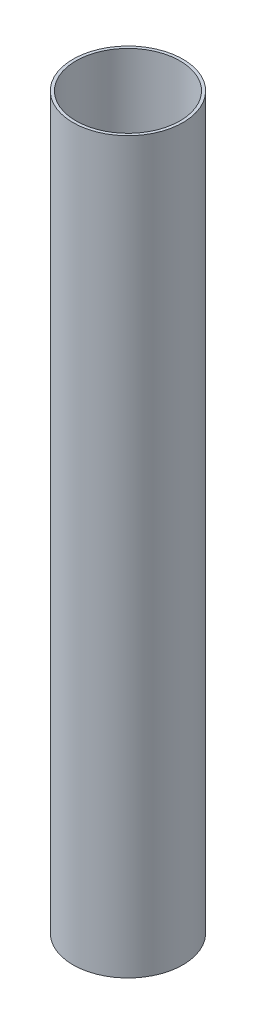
from build123d import *

# Parameters (mm, degrees)
SKETCH1_R           = 28.702
SKETCH1_R_2         = 27.178
EXTRUDE_THIN1_DEPTH = 381


with BuildPart() as part:
    # Sketch1 → Extrude-Thin1 (new body)
    with BuildSketch(Plane(origin=(0, 0, 0), x_dir=(1, 0, 0), z_dir=(0, 1, 0))):
        Circle(SKETCH1_R)
        Circle(SKETCH1_R_2, mode=Mode.SUBTRACT)
    extrude(amount=EXTRUDE_THIN1_DEPTH)


solid = part.part
